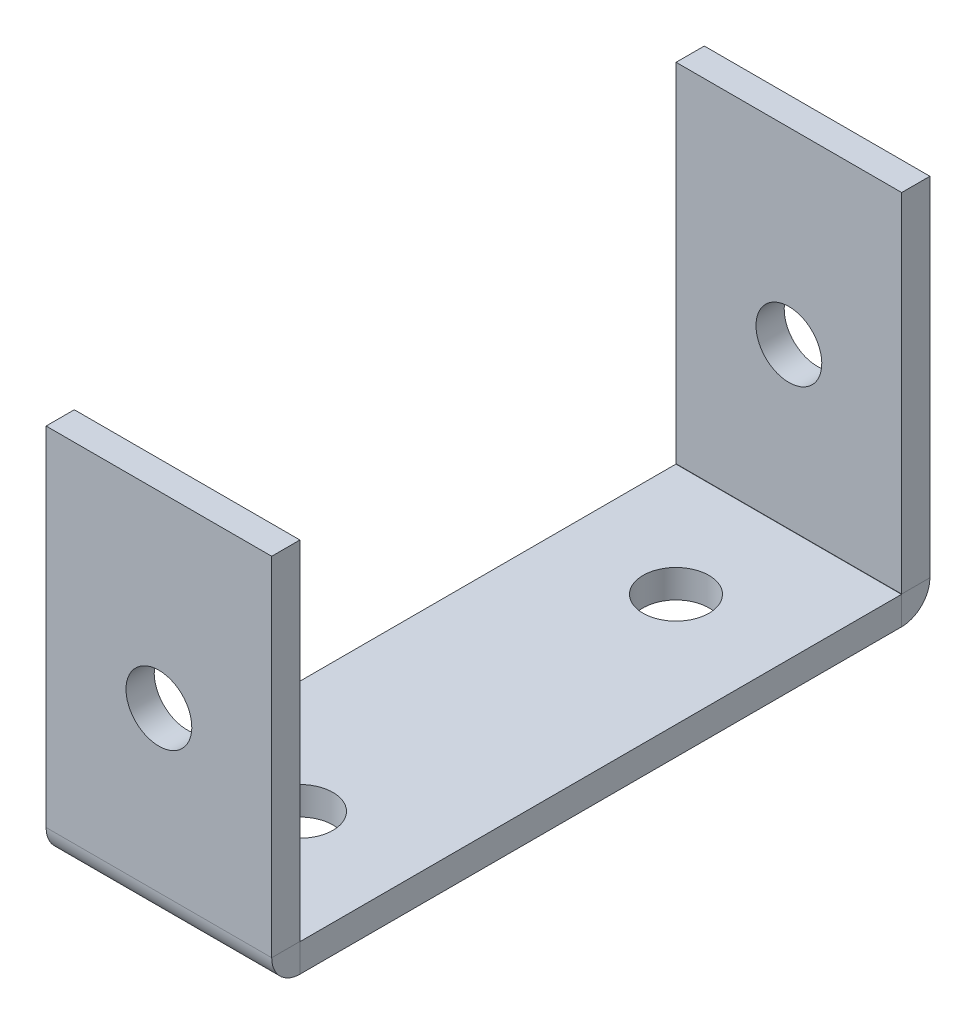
ISO-10303-21;
HEADER;
FILE_DESCRIPTION(('STEP AP214'),'2;1');
FILE_NAME('part.step','',(''),(''),'','','');
FILE_SCHEMA(('AUTOMOTIVE_DESIGN { 1 0 10303 214 1 1 1 1 }'));
ENDSEC;
DATA;
#1=APPLICATION_CONTEXT('core data for automotive mechanical design processes');
#2=APPLICATION_PROTOCOL_DEFINITION('international standard','automotive_design',2000,#1);
#3=PRODUCT_CONTEXT('',#1,'mechanical');
#4=PRODUCT('Part','Part','',(#3));
#5=PRODUCT_RELATED_PRODUCT_CATEGORY('part','',(#4));
#6=PRODUCT_DEFINITION_FORMATION('','',#4);
#7=PRODUCT_DEFINITION_CONTEXT('part definition',#1,'design');
#8=PRODUCT_DEFINITION('design','',#6,#7);
#9=PRODUCT_DEFINITION_SHAPE('','',#8);
#10=(LENGTH_UNIT() NAMED_UNIT(*) SI_UNIT(.MILLI.,.METRE.));
#11=(NAMED_UNIT(*) PLANE_ANGLE_UNIT() SI_UNIT($,.RADIAN.));
#12=(NAMED_UNIT(*) SI_UNIT($,.STERADIAN.) SOLID_ANGLE_UNIT());
#13=UNCERTAINTY_MEASURE_WITH_UNIT(LENGTH_MEASURE(1.E-05),#10,'distance_accuracy_value','');
#14=(GEOMETRIC_REPRESENTATION_CONTEXT(3) GLOBAL_UNCERTAINTY_ASSIGNED_CONTEXT((#13)) GLOBAL_UNIT_ASSIGNED_CONTEXT((#10,
#11,#12)) REPRESENTATION_CONTEXT('',''));
#15=CARTESIAN_POINT('',(0.,0.,0.));
#16=DIRECTION('',(0.,0.,1.));
#17=DIRECTION('',(1.,0.,0.));
#18=AXIS2_PLACEMENT_3D('',#15,#16,#17);
#19=CARTESIAN_POINT('',(12.,1.5,0.));
#20=DIRECTION('',(-1.,0.,0.));
#21=DIRECTION('',(0.,0.,1.));
#22=AXIS2_PLACEMENT_3D('',#19,#20,#21);
#23=PLANE('',#22);
#24=DIRECTION('',(0.,0.,-1.));
#25=VECTOR('',#24,1.);
#26=CARTESIAN_POINT('',(12.,1.5,0.));
#27=LINE('',#26,#25);
#28=CARTESIAN_POINT('',(12.,1.50000000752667,-21.505));
#29=VERTEX_POINT('',#28);
#30=CARTESIAN_POINT('',(12.,1.5,-53.495));
#31=VERTEX_POINT('',#30);
#32=EDGE_CURVE('E247',#29,#31,#27,.T.);
#33=ORIENTED_EDGE('',*,*,#32,.F.);
#34=DIRECTION('',(0.,-1.,0.));
#35=VECTOR('',#34,1.);
#36=CARTESIAN_POINT('',(12.,1.5,-21.505));
#37=LINE('',#36,#35);
#38=CARTESIAN_POINT('',(12.,0.,-21.505));
#39=VERTEX_POINT('',#38);
#40=EDGE_CURVE('E12',#29,#39,#37,.T.);
#41=ORIENTED_EDGE('',*,*,#40,.T.);
#42=DIRECTION('',(0.,0.,-1.));
#43=VECTOR('',#42,1.);
#44=CARTESIAN_POINT('',(12.,0.,0.));
#45=LINE('',#44,#43);
#46=CARTESIAN_POINT('',(12.,0.,-53.495));
#47=VERTEX_POINT('',#46);
#48=EDGE_CURVE('E262',#39,#47,#45,.T.);
#49=ORIENTED_EDGE('',*,*,#48,.T.);
#50=DIRECTION('',(0.,-1.,0.));
#51=VECTOR('',#50,1.);
#52=CARTESIAN_POINT('',(12.,1.5,-53.495));
#53=LINE('',#52,#51);
#54=EDGE_CURVE('E246',#31,#47,#53,.T.);
#55=ORIENTED_EDGE('',*,*,#54,.F.);
#56=EDGE_LOOP('',(#33,#41,#49,#55));
#57=FACE_BOUND('',#56,.T.);
#58=ADVANCED_FACE('F40',(#57),#23,.F.);
#59=CARTESIAN_POINT('',(0.,1.5,0.));
#60=DIRECTION('',(1.,0.,0.));
#61=DIRECTION('',(0.,0.,-1.));
#62=AXIS2_PLACEMENT_3D('',#59,#60,#61);
#63=PLANE('',#62);
#64=DIRECTION('',(0.,0.,1.));
#65=VECTOR('',#64,1.);
#66=CARTESIAN_POINT('',(0.,0.,0.));
#67=LINE('',#66,#65);
#68=CARTESIAN_POINT('',(0.,0.,-53.495));
#69=VERTEX_POINT('',#68);
#70=CARTESIAN_POINT('',(0.,1.50533502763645E-08,-21.5049999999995));
#71=VERTEX_POINT('',#70);
#72=EDGE_CURVE('E62',#69,#71,#67,.T.);
#73=ORIENTED_EDGE('',*,*,#72,.T.);
#74=DIRECTION('',(0.,1.,0.));
#75=VECTOR('',#74,1.);
#76=CARTESIAN_POINT('',(0.,1.5,-21.505));
#77=LINE('',#76,#75);
#78=CARTESIAN_POINT('',(0.,1.50000000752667,-21.505));
#79=VERTEX_POINT('',#78);
#80=EDGE_CURVE('E258',#71,#79,#77,.T.);
#81=ORIENTED_EDGE('',*,*,#80,.T.);
#82=DIRECTION('',(0.,0.,1.));
#83=VECTOR('',#82,1.);
#84=CARTESIAN_POINT('',(0.,1.5,0.));
#85=LINE('',#84,#83);
#86=CARTESIAN_POINT('',(0.,1.4999999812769,-53.495));
#87=VERTEX_POINT('',#86);
#88=EDGE_CURVE('E43',#87,#79,#85,.T.);
#89=ORIENTED_EDGE('',*,*,#88,.F.);
#90=DIRECTION('',(0.,1.,0.));
#91=VECTOR('',#90,1.);
#92=CARTESIAN_POINT('',(0.,1.5,-53.495));
#93=LINE('',#92,#91);
#94=EDGE_CURVE('E252',#69,#87,#93,.T.);
#95=ORIENTED_EDGE('',*,*,#94,.F.);
#96=EDGE_LOOP('',(#73,#81,#89,#95));
#97=FACE_BOUND('',#96,.T.);
#98=ADVANCED_FACE('F272',(#97),#63,.F.);
#99=CARTESIAN_POINT('',(0.,1.5,-75.));
#100=DIRECTION('',(0.,-1.,0.));
#101=DIRECTION('',(0.,0.,-1.));
#102=AXIS2_PLACEMENT_3D('',#99,#100,#101);
#103=PLANE('',#102);
#104=CARTESIAN_POINT('',(6.,1.5,-47.5));
#105=DIRECTION('',(0.,1.,0.));
#106=DIRECTION('',(0.,0.,1.));
#107=AXIS2_PLACEMENT_3D('',#104,#105,#106);
#108=CIRCLE('',#107,1.75);
#109=CARTESIAN_POINT('',(6.,1.5,-45.75));
#110=VERTEX_POINT('',#109);
#111=EDGE_CURVE('E240',#110,#110,#108,.T.);
#112=ORIENTED_EDGE('',*,*,#111,.F.);
#113=EDGE_LOOP('',(#112));
#114=FACE_BOUND('',#113,.T.);
#115=CARTESIAN_POINT('',(6.,1.5,-27.5));
#116=DIRECTION('',(0.,1.,0.));
#117=DIRECTION('',(0.,0.,1.));
#118=AXIS2_PLACEMENT_3D('',#115,#116,#117);
#119=CIRCLE('',#118,1.75);
#120=CARTESIAN_POINT('',(6.,1.5,-25.75));
#121=VERTEX_POINT('',#120);
#122=EDGE_CURVE('E234',#121,#121,#119,.T.);
#123=ORIENTED_EDGE('',*,*,#122,.F.);
#124=EDGE_LOOP('',(#123));
#125=FACE_BOUND('',#124,.T.);
#126=ORIENTED_EDGE('',*,*,#88,.T.);
#127=DIRECTION('',(1.,0.,0.));
#128=VECTOR('',#127,1.);
#129=CARTESIAN_POINT('',(0.,1.5,-21.505));
#130=LINE('',#129,#128);
#131=EDGE_CURVE('E255',#79,#29,#130,.T.);
#132=ORIENTED_EDGE('',*,*,#131,.T.);
#133=ORIENTED_EDGE('',*,*,#32,.T.);
#134=DIRECTION('',(1.,0.,0.));
#135=VECTOR('',#134,1.);
#136=CARTESIAN_POINT('',(0.,1.5,-53.495));
#137=LINE('',#136,#135);
#138=EDGE_CURVE('E243',#87,#31,#137,.T.);
#139=ORIENTED_EDGE('',*,*,#138,.F.);
#140=EDGE_LOOP('',(#126,#132,#133,#139));
#141=FACE_BOUND('',#140,.T.);
#142=ADVANCED_FACE('F269',(#114,#125,#141),#103,.F.);
#143=CARTESIAN_POINT('',(0.,0.,-75.));
#144=DIRECTION('',(0.,-1.,0.));
#145=DIRECTION('',(0.,0.,-1.));
#146=AXIS2_PLACEMENT_3D('',#143,#144,#145);
#147=PLANE('',#146);
#148=DIRECTION('',(1.,0.,0.));
#149=VECTOR('',#148,1.);
#150=CARTESIAN_POINT('',(0.,0.,-21.505));
#151=LINE('',#150,#149);
#152=EDGE_CURVE('E48',#71,#39,#151,.T.);
#153=ORIENTED_EDGE('',*,*,#152,.F.);
#154=ORIENTED_EDGE('',*,*,#72,.F.);
#155=DIRECTION('',(1.,0.,0.));
#156=VECTOR('',#155,1.);
#157=CARTESIAN_POINT('',(0.,0.,-53.495));
#158=LINE('',#157,#156);
#159=EDGE_CURVE('E250',#69,#47,#158,.T.);
#160=ORIENTED_EDGE('',*,*,#159,.T.);
#161=ORIENTED_EDGE('',*,*,#48,.F.);
#162=EDGE_LOOP('',(#153,#154,#160,#161));
#163=FACE_BOUND('',#162,.T.);
#164=CARTESIAN_POINT('',(6.,0.,-27.5));
#165=DIRECTION('',(0.,1.,0.));
#166=DIRECTION('',(0.,0.,1.));
#167=AXIS2_PLACEMENT_3D('',#164,#165,#166);
#168=CIRCLE('',#167,1.75);
#169=CARTESIAN_POINT('',(6.,0.,-25.75));
#170=VERTEX_POINT('',#169);
#171=EDGE_CURVE('E231',#170,#170,#168,.T.);
#172=ORIENTED_EDGE('',*,*,#171,.T.);
#173=EDGE_LOOP('',(#172));
#174=FACE_BOUND('',#173,.T.);
#175=CARTESIAN_POINT('',(6.,0.,-47.5));
#176=DIRECTION('',(0.,1.,0.));
#177=DIRECTION('',(0.,0.,1.));
#178=AXIS2_PLACEMENT_3D('',#175,#176,#177);
#179=CIRCLE('',#178,1.75);
#180=CARTESIAN_POINT('',(6.,0.,-45.75));
#181=VERTEX_POINT('',#180);
#182=EDGE_CURVE('E237',#181,#181,#179,.T.);
#183=ORIENTED_EDGE('',*,*,#182,.T.);
#184=EDGE_LOOP('',(#183));
#185=FACE_BOUND('',#184,.T.);
#186=ADVANCED_FACE('F340',(#163,#174,#185),#147,.T.);
#187=CARTESIAN_POINT('',(6.,1.5,-47.5));
#188=DIRECTION('',(0.,-1.,0.));
#189=DIRECTION('',(0.,0.,-1.));
#190=AXIS2_PLACEMENT_3D('',#187,#188,#189);
#191=CYLINDRICAL_SURFACE('',#190,1.75);
#192=ORIENTED_EDGE('',*,*,#111,.T.);
#193=EDGE_LOOP('',(#192));
#194=FACE_BOUND('',#193,.T.);
#195=ORIENTED_EDGE('',*,*,#182,.F.);
#196=EDGE_LOOP('',(#195));
#197=FACE_BOUND('',#196,.T.);
#198=ADVANCED_FACE('F343',(#194,#197),#191,.F.);
#199=CARTESIAN_POINT('',(6.,1.5,-27.5));
#200=DIRECTION('',(0.,-1.,0.));
#201=DIRECTION('',(0.,0.,-1.));
#202=AXIS2_PLACEMENT_3D('',#199,#200,#201);
#203=CYLINDRICAL_SURFACE('',#202,1.75);
#204=ORIENTED_EDGE('',*,*,#122,.T.);
#205=EDGE_LOOP('',(#204));
#206=FACE_BOUND('',#205,.T.);
#207=ORIENTED_EDGE('',*,*,#171,.F.);
#208=EDGE_LOOP('',(#207));
#209=FACE_BOUND('',#208,.T.);
#210=ADVANCED_FACE('F349',(#206,#209),#203,.F.);
#211=CARTESIAN_POINT('',(0.,1.51000003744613,-53.495));
#212=DIRECTION('',(1.,0.,0.));
#213=DIRECTION('',(0.,0.,-1.));
#214=AXIS2_PLACEMENT_3D('',#211,#212,#213);
#215=PLANE('',#214);
#216=DIRECTION('',(0.,0.,1.));
#217=VECTOR('',#216,1.);
#218=CARTESIAN_POINT('',(0.,1.51,-53.505));
#219=LINE('',#218,#217);
#220=CARTESIAN_POINT('',(0.,1.51,-55.005));
#221=VERTEX_POINT('',#220);
#222=CARTESIAN_POINT('',(0.,1.51,-53.505));
#223=VERTEX_POINT('',#222);
#224=EDGE_CURVE('E188',#221,#223,#219,.T.);
#225=ORIENTED_EDGE('',*,*,#224,.F.);
#226=CARTESIAN_POINT('',(0.,1.51,-53.495));
#227=DIRECTION('',(-1.,0.,0.));
#228=DIRECTION('',(0.,0.,1.));
#229=AXIS2_PLACEMENT_3D('',#226,#227,#228);
#230=CIRCLE('',#229,1.51000003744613);
#231=EDGE_CURVE('E187',#221,#69,#230,.T.);
#232=ORIENTED_EDGE('',*,*,#231,.T.);
#233=ORIENTED_EDGE('',*,*,#94,.T.);
#234=CARTESIAN_POINT('',(0.,1.51000003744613,-53.495));
#235=DIRECTION('',(-1.,0.,0.));
#236=DIRECTION('',(0.,0.,1.));
#237=AXIS2_PLACEMENT_3D('',#234,#235,#236);
#238=CIRCLE('',#237,0.0100000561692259);
#239=EDGE_CURVE('E223',#223,#87,#238,.T.);
#240=ORIENTED_EDGE('',*,*,#239,.F.);
#241=EDGE_LOOP('',(#225,#232,#233,#240));
#242=FACE_BOUND('',#241,.T.);
#243=ADVANCED_FACE('F336',(#242),#215,.F.);
#244=CARTESIAN_POINT('',(12.,1.51000003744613,-53.495));
#245=DIRECTION('',(-1.,0.,0.));
#246=DIRECTION('',(0.,0.,1.));
#247=AXIS2_PLACEMENT_3D('',#244,#245,#246);
#248=PLANE('',#247);
#249=ORIENTED_EDGE('',*,*,#54,.T.);
#250=CARTESIAN_POINT('',(12.,1.51,-53.495));
#251=DIRECTION('',(-1.,0.,0.));
#252=DIRECTION('',(0.,0.,1.));
#253=AXIS2_PLACEMENT_3D('',#250,#251,#252);
#254=CIRCLE('',#253,1.51000003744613);
#255=CARTESIAN_POINT('',(12.,1.51,-55.005));
#256=VERTEX_POINT('',#255);
#257=EDGE_CURVE('E220',#47,#256,#254,.F.);
#258=ORIENTED_EDGE('',*,*,#257,.T.);
#259=DIRECTION('',(0.,0.,-1.));
#260=VECTOR('',#259,1.);
#261=CARTESIAN_POINT('',(12.,1.51,-53.505));
#262=LINE('',#261,#260);
#263=CARTESIAN_POINT('',(12.,1.50999999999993,-53.5050000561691));
#264=VERTEX_POINT('',#263);
#265=EDGE_CURVE('E198',#264,#256,#262,.T.);
#266=ORIENTED_EDGE('',*,*,#265,.F.);
#267=CARTESIAN_POINT('',(12.,1.51000003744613,-53.495));
#268=DIRECTION('',(1.,0.,0.));
#269=DIRECTION('',(0.,0.,-1.));
#270=AXIS2_PLACEMENT_3D('',#267,#268,#269);
#271=CIRCLE('',#270,0.0100000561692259);
#272=EDGE_CURVE('E228',#31,#264,#271,.T.);
#273=ORIENTED_EDGE('',*,*,#272,.F.);
#274=EDGE_LOOP('',(#249,#258,#266,#273));
#275=FACE_BOUND('',#274,.T.);
#276=ADVANCED_FACE('F320',(#275),#248,.F.);
#277=CARTESIAN_POINT('',(18.46234729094,1.51,-53.495));
#278=DIRECTION('',(-1.,0.,0.));
#279=DIRECTION('',(0.,0.,1.));
#280=AXIS2_PLACEMENT_3D('',#277,#278,#279);
#281=CYLINDRICAL_SURFACE('',#280,0.010000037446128);
#282=ORIENTED_EDGE('',*,*,#272,.T.);
#283=DIRECTION('',(1.,0.,0.));
#284=VECTOR('',#283,1.);
#285=CARTESIAN_POINT('',(0.,1.51,-53.505));
#286=LINE('',#285,#284);
#287=EDGE_CURVE('E205',#223,#264,#286,.T.);
#288=ORIENTED_EDGE('',*,*,#287,.F.);
#289=ORIENTED_EDGE('',*,*,#239,.T.);
#290=ORIENTED_EDGE('',*,*,#138,.T.);
#291=EDGE_LOOP('',(#282,#288,#289,#290));
#292=FACE_BOUND('',#291,.T.);
#293=ADVANCED_FACE('F316',(#292),#281,.F.);
#294=CARTESIAN_POINT('',(18.46234729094,1.51,-53.495));
#295=DIRECTION('',(-1.,0.,0.));
#296=DIRECTION('',(0.,0.,1.));
#297=AXIS2_PLACEMENT_3D('',#294,#295,#296);
#298=CYLINDRICAL_SURFACE('',#297,1.51000003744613);
#299=ORIENTED_EDGE('',*,*,#257,.F.);
#300=ORIENTED_EDGE('',*,*,#159,.F.);
#301=ORIENTED_EDGE('',*,*,#231,.F.);
#302=DIRECTION('',(1.,0.,0.));
#303=VECTOR('',#302,1.);
#304=CARTESIAN_POINT('',(0.,1.51,-55.005));
#305=LINE('',#304,#303);
#306=EDGE_CURVE('E183',#221,#256,#305,.T.);
#307=ORIENTED_EDGE('',*,*,#306,.T.);
#308=EDGE_LOOP('',(#299,#300,#301,#307));
#309=FACE_BOUND('',#308,.T.);
#310=ADVANCED_FACE('F339',(#309),#298,.T.);
#311=CARTESIAN_POINT('',(0.,20.005,-53.5049999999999));
#312=DIRECTION('',(0.,-1.,0.));
#313=DIRECTION('',(1.,0.,0.));
#314=AXIS2_PLACEMENT_3D('',#311,#312,#313);
#315=PLANE('',#314);
#316=DIRECTION('',(-1.,0.,0.));
#317=VECTOR('',#316,1.);
#318=CARTESIAN_POINT('',(0.,20.005,-55.0049999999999));
#319=LINE('',#318,#317);
#320=CARTESIAN_POINT('',(12.,20.005,-55.0049999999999));
#321=VERTEX_POINT('',#320);
#322=CARTESIAN_POINT('',(0.,20.005,-55.0049999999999));
#323=VERTEX_POINT('',#322);
#324=EDGE_CURVE('E216',#321,#323,#319,.T.);
#325=ORIENTED_EDGE('',*,*,#324,.T.);
#326=DIRECTION('',(0.,0.,-1.));
#327=VECTOR('',#326,1.);
#328=CARTESIAN_POINT('',(0.,20.005,-53.5049999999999));
#329=LINE('',#328,#327);
#330=CARTESIAN_POINT('',(0.,20.005,-53.5049999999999));
#331=VERTEX_POINT('',#330);
#332=EDGE_CURVE('E184',#331,#323,#329,.T.);
#333=ORIENTED_EDGE('',*,*,#332,.F.);
#334=DIRECTION('',(-1.,0.,0.));
#335=VECTOR('',#334,1.);
#336=CARTESIAN_POINT('',(0.,20.005,-53.5049999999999));
#337=LINE('',#336,#335);
#338=CARTESIAN_POINT('',(12.,20.005,-53.5049999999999));
#339=VERTEX_POINT('',#338);
#340=EDGE_CURVE('E201',#339,#331,#337,.T.);
#341=ORIENTED_EDGE('',*,*,#340,.F.);
#342=DIRECTION('',(0.,0.,-1.));
#343=VECTOR('',#342,1.);
#344=CARTESIAN_POINT('',(12.,20.005,-53.5049999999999));
#345=LINE('',#344,#343);
#346=EDGE_CURVE('E213',#339,#321,#345,.T.);
#347=ORIENTED_EDGE('',*,*,#346,.T.);
#348=EDGE_LOOP('',(#325,#333,#341,#347));
#349=FACE_BOUND('',#348,.T.);
#350=ADVANCED_FACE('F410',(#349),#315,.F.);
#351=CARTESIAN_POINT('',(6.,10.005,-53.505));
#352=DIRECTION('',(0.,0.,-1.));
#353=DIRECTION('',(0.,1.,0.));
#354=AXIS2_PLACEMENT_3D('',#351,#352,#353);
#355=CYLINDRICAL_SURFACE('',#354,1.75);
#356=CARTESIAN_POINT('',(6.,10.005,-53.505));
#357=DIRECTION('',(0.,0.,1.));
#358=DIRECTION('',(0.,-1.,0.));
#359=AXIS2_PLACEMENT_3D('',#356,#357,#358);
#360=CIRCLE('',#359,1.75);
#361=CARTESIAN_POINT('',(6.,8.25500000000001,-53.505));
#362=VERTEX_POINT('',#361);
#363=EDGE_CURVE('E210',#362,#362,#360,.T.);
#364=ORIENTED_EDGE('',*,*,#363,.T.);
#365=EDGE_LOOP('',(#364));
#366=FACE_BOUND('',#365,.T.);
#367=CARTESIAN_POINT('',(6.,10.005,-55.005));
#368=DIRECTION('',(0.,0.,1.));
#369=DIRECTION('',(0.,-1.,0.));
#370=AXIS2_PLACEMENT_3D('',#367,#368,#369);
#371=CIRCLE('',#370,1.75);
#372=CARTESIAN_POINT('',(6.,8.25500000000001,-55.005));
#373=VERTEX_POINT('',#372);
#374=EDGE_CURVE('E193',#373,#373,#371,.T.);
#375=ORIENTED_EDGE('',*,*,#374,.F.);
#376=EDGE_LOOP('',(#375));
#377=FACE_BOUND('',#376,.T.);
#378=ADVANCED_FACE('F421',(#366,#377),#355,.F.);
#379=CARTESIAN_POINT('',(0.,20.005,-53.5049999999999));
#380=DIRECTION('',(0.,0.,-1.));
#381=DIRECTION('',(0.,1.,0.));
#382=AXIS2_PLACEMENT_3D('',#379,#380,#381);
#383=PLANE('',#382);
#384=ORIENTED_EDGE('',*,*,#363,.F.);
#385=EDGE_LOOP('',(#384));
#386=FACE_BOUND('',#385,.T.);
#387=DIRECTION('',(0.,-1.,0.));
#388=VECTOR('',#387,1.);
#389=CARTESIAN_POINT('',(0.,-54.995,-53.5050000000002));
#390=LINE('',#389,#388);
#391=EDGE_CURVE('E208',#331,#223,#390,.T.);
#392=ORIENTED_EDGE('',*,*,#391,.T.);
#393=ORIENTED_EDGE('',*,*,#287,.T.);
#394=DIRECTION('',(0.,1.,0.));
#395=VECTOR('',#394,1.);
#396=CARTESIAN_POINT('',(12.,-54.995,-53.5050000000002));
#397=LINE('',#396,#395);
#398=EDGE_CURVE('E203',#264,#339,#397,.T.);
#399=ORIENTED_EDGE('',*,*,#398,.T.);
#400=ORIENTED_EDGE('',*,*,#340,.T.);
#401=EDGE_LOOP('',(#392,#393,#399,#400));
#402=FACE_BOUND('',#401,.T.);
#403=ADVANCED_FACE('F326',(#386,#402),#383,.F.);
#404=CARTESIAN_POINT('',(12.,-54.995,-53.5050000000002));
#405=DIRECTION('',(-1.,0.,0.));
#406=DIRECTION('',(0.,-1.,0.));
#407=AXIS2_PLACEMENT_3D('',#404,#405,#406);
#408=PLANE('',#407);
#409=ORIENTED_EDGE('',*,*,#398,.F.);
#410=ORIENTED_EDGE('',*,*,#265,.T.);
#411=DIRECTION('',(0.,1.,0.));
#412=VECTOR('',#411,1.);
#413=CARTESIAN_POINT('',(12.,-54.995,-55.0050000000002));
#414=LINE('',#413,#412);
#415=EDGE_CURVE('E196',#256,#321,#414,.T.);
#416=ORIENTED_EDGE('',*,*,#415,.T.);
#417=ORIENTED_EDGE('',*,*,#346,.F.);
#418=EDGE_LOOP('',(#409,#410,#416,#417));
#419=FACE_BOUND('',#418,.T.);
#420=ADVANCED_FACE('F322',(#419),#408,.F.);
#421=CARTESIAN_POINT('',(0.,20.005,-55.0049999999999));
#422=DIRECTION('',(0.,0.,-1.));
#423=DIRECTION('',(0.,1.,0.));
#424=AXIS2_PLACEMENT_3D('',#421,#422,#423);
#425=PLANE('',#424);
#426=ORIENTED_EDGE('',*,*,#306,.F.);
#427=DIRECTION('',(0.,-1.,0.));
#428=VECTOR('',#427,1.);
#429=CARTESIAN_POINT('',(0.,-54.995,-55.0050000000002));
#430=LINE('',#429,#428);
#431=EDGE_CURVE('E191',#323,#221,#430,.T.);
#432=ORIENTED_EDGE('',*,*,#431,.F.);
#433=ORIENTED_EDGE('',*,*,#324,.F.);
#434=ORIENTED_EDGE('',*,*,#415,.F.);
#435=EDGE_LOOP('',(#426,#432,#433,#434));
#436=FACE_BOUND('',#435,.T.);
#437=ORIENTED_EDGE('',*,*,#374,.T.);
#438=EDGE_LOOP('',(#437));
#439=FACE_BOUND('',#438,.T.);
#440=ADVANCED_FACE('F454',(#436,#439),#425,.T.);
#441=CARTESIAN_POINT('',(0.,-54.995,-53.5050000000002));
#442=DIRECTION('',(1.,0.,0.));
#443=DIRECTION('',(0.,1.,0.));
#444=AXIS2_PLACEMENT_3D('',#441,#442,#443);
#445=PLANE('',#444);
#446=ORIENTED_EDGE('',*,*,#431,.T.);
#447=ORIENTED_EDGE('',*,*,#224,.T.);
#448=ORIENTED_EDGE('',*,*,#391,.F.);
#449=ORIENTED_EDGE('',*,*,#332,.T.);
#450=EDGE_LOOP('',(#446,#447,#448,#449));
#451=FACE_BOUND('',#450,.T.);
#452=ADVANCED_FACE('F331',(#451),#445,.F.);
#453=CARTESIAN_POINT('',(0.,1.50999998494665,-21.505));
#454=DIRECTION('',(1.,0.,0.));
#455=DIRECTION('',(0.,0.,-1.));
#456=AXIS2_PLACEMENT_3D('',#453,#454,#455);
#457=PLANE('',#456);
#458=ORIENTED_EDGE('',*,*,#80,.F.);
#459=CARTESIAN_POINT('',(0.,1.51,-21.505));
#460=DIRECTION('',(1.,0.,0.));
#461=DIRECTION('',(0.,0.,-1.));
#462=AXIS2_PLACEMENT_3D('',#459,#460,#461);
#463=CIRCLE('',#462,1.50999998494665);
#464=CARTESIAN_POINT('',(0.,1.51000000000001,-19.995));
#465=VERTEX_POINT('',#464);
#466=EDGE_CURVE('E175',#71,#465,#463,.F.);
#467=ORIENTED_EDGE('',*,*,#466,.T.);
#468=DIRECTION('',(0.,0.,-1.));
#469=VECTOR('',#468,1.);
#470=CARTESIAN_POINT('',(0.,1.51,-21.495));
#471=LINE('',#470,#469);
#472=CARTESIAN_POINT('',(0.,1.51,-21.495));
#473=VERTEX_POINT('',#472);
#474=EDGE_CURVE('E139',#465,#473,#471,.T.);
#475=ORIENTED_EDGE('',*,*,#474,.T.);
#476=CARTESIAN_POINT('',(0.,1.50999998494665,-21.505));
#477=DIRECTION('',(-1.,0.,0.));
#478=DIRECTION('',(0.,0.,1.));
#479=AXIS2_PLACEMENT_3D('',#476,#477,#478);
#480=CIRCLE('',#479,0.00999997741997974);
#481=EDGE_CURVE('E174',#79,#473,#480,.T.);
#482=ORIENTED_EDGE('',*,*,#481,.F.);
#483=EDGE_LOOP('',(#458,#467,#475,#482));
#484=FACE_BOUND('',#483,.T.);
#485=ADVANCED_FACE('F274',(#484),#457,.F.);
#486=CARTESIAN_POINT('',(12.,1.50999998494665,-21.505));
#487=DIRECTION('',(-1.,0.,0.));
#488=DIRECTION('',(0.,0.,1.));
#489=AXIS2_PLACEMENT_3D('',#486,#487,#488);
#490=PLANE('',#489);
#491=DIRECTION('',(0.,0.,1.));
#492=VECTOR('',#491,1.);
#493=CARTESIAN_POINT('',(12.,1.51,-21.495));
#494=LINE('',#493,#492);
#495=CARTESIAN_POINT('',(12.,1.51,-21.4950000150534));
#496=VERTEX_POINT('',#495);
#497=CARTESIAN_POINT('',(12.,1.51000000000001,-19.995));
#498=VERTEX_POINT('',#497);
#499=EDGE_CURVE('E166',#496,#498,#494,.T.);
#500=ORIENTED_EDGE('',*,*,#499,.T.);
#501=CARTESIAN_POINT('',(12.,1.51,-21.505));
#502=DIRECTION('',(1.,0.,0.));
#503=DIRECTION('',(0.,0.,-1.));
#504=AXIS2_PLACEMENT_3D('',#501,#502,#503);
#505=CIRCLE('',#504,1.50999998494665);
#506=EDGE_CURVE('E172',#498,#39,#505,.T.);
#507=ORIENTED_EDGE('',*,*,#506,.T.);
#508=ORIENTED_EDGE('',*,*,#40,.F.);
#509=CARTESIAN_POINT('',(12.,1.50999998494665,-21.505));
#510=DIRECTION('',(1.,0.,0.));
#511=DIRECTION('',(0.,0.,-1.));
#512=AXIS2_PLACEMENT_3D('',#509,#510,#511);
#513=CIRCLE('',#512,0.00999997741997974);
#514=EDGE_CURVE('E180',#496,#29,#513,.T.);
#515=ORIENTED_EDGE('',*,*,#514,.F.);
#516=EDGE_LOOP('',(#500,#507,#508,#515));
#517=FACE_BOUND('',#516,.T.);
#518=ADVANCED_FACE('F293',(#517),#490,.F.);
#519=CARTESIAN_POINT('',(-6.46234729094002,1.51,-21.505));
#520=DIRECTION('',(1.,0.,0.));
#521=DIRECTION('',(0.,0.,-1.));
#522=AXIS2_PLACEMENT_3D('',#519,#520,#521);
#523=CYLINDRICAL_SURFACE('',#522,0.0099999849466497);
#524=ORIENTED_EDGE('',*,*,#514,.T.);
#525=ORIENTED_EDGE('',*,*,#131,.F.);
#526=ORIENTED_EDGE('',*,*,#481,.T.);
#527=DIRECTION('',(1.,0.,0.));
#528=VECTOR('',#527,1.);
#529=CARTESIAN_POINT('',(0.,1.51,-21.495));
#530=LINE('',#529,#528);
#531=EDGE_CURVE('E169',#473,#496,#530,.T.);
#532=ORIENTED_EDGE('',*,*,#531,.T.);
#533=EDGE_LOOP('',(#524,#525,#526,#532));
#534=FACE_BOUND('',#533,.T.);
#535=ADVANCED_FACE('F296',(#534),#523,.F.);
#536=CARTESIAN_POINT('',(-6.46234729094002,1.51,-21.505));
#537=DIRECTION('',(1.,0.,0.));
#538=DIRECTION('',(0.,0.,-1.));
#539=AXIS2_PLACEMENT_3D('',#536,#537,#538);
#540=CYLINDRICAL_SURFACE('',#539,1.50999998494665);
#541=ORIENTED_EDGE('',*,*,#506,.F.);
#542=DIRECTION('',(1.,0.,0.));
#543=VECTOR('',#542,1.);
#544=CARTESIAN_POINT('',(0.,1.51,-19.995));
#545=LINE('',#544,#543);
#546=EDGE_CURVE('E276',#465,#498,#545,.T.);
#547=ORIENTED_EDGE('',*,*,#546,.F.);
#548=ORIENTED_EDGE('',*,*,#466,.F.);
#549=ORIENTED_EDGE('',*,*,#152,.T.);
#550=EDGE_LOOP('',(#541,#547,#548,#549));
#551=FACE_BOUND('',#550,.T.);
#552=ADVANCED_FACE('F275',(#551),#540,.T.);
#553=CARTESIAN_POINT('',(6.,10.005,-21.495));
#554=DIRECTION('',(0.,0.,1.));
#555=DIRECTION('',(0.,-1.,0.));
#556=AXIS2_PLACEMENT_3D('',#553,#554,#555);
#557=CYLINDRICAL_SURFACE('',#556,1.75);
#558=CARTESIAN_POINT('',(6.,10.005,-21.495));
#559=DIRECTION('',(0.,0.,-1.));
#560=DIRECTION('',(0.,1.,0.));
#561=AXIS2_PLACEMENT_3D('',#558,#559,#560);
#562=CIRCLE('',#561,1.75);
#563=CARTESIAN_POINT('',(6.,11.755,-21.495));
#564=VERTEX_POINT('',#563);
#565=EDGE_CURVE('E153',#564,#564,#562,.T.);
#566=ORIENTED_EDGE('',*,*,#565,.T.);
#567=EDGE_LOOP('',(#566));
#568=FACE_BOUND('',#567,.T.);
#569=CARTESIAN_POINT('',(6.,10.005,-19.995));
#570=DIRECTION('',(0.,0.,-1.));
#571=DIRECTION('',(0.,1.,0.));
#572=AXIS2_PLACEMENT_3D('',#569,#570,#571);
#573=CIRCLE('',#572,1.75);
#574=CARTESIAN_POINT('',(6.,11.755,-19.995));
#575=VERTEX_POINT('',#574);
#576=EDGE_CURVE('E143',#575,#575,#573,.T.);
#577=ORIENTED_EDGE('',*,*,#576,.F.);
#578=EDGE_LOOP('',(#577));
#579=FACE_BOUND('',#578,.T.);
#580=ADVANCED_FACE('F303',(#568,#579),#557,.F.);
#581=CARTESIAN_POINT('',(0.,20.005,-21.4950000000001));
#582=DIRECTION('',(0.,-1.,0.));
#583=DIRECTION('',(-1.,0.,0.));
#584=AXIS2_PLACEMENT_3D('',#581,#582,#583);
#585=PLANE('',#584);
#586=DIRECTION('',(1.,0.,0.));
#587=VECTOR('',#586,1.);
#588=CARTESIAN_POINT('',(0.,20.005,-19.9950000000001));
#589=LINE('',#588,#587);
#590=CARTESIAN_POINT('',(0.,20.005,-19.9950000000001));
#591=VERTEX_POINT('',#590);
#592=CARTESIAN_POINT('',(12.,20.005,-19.9950000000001));
#593=VERTEX_POINT('',#592);
#594=EDGE_CURVE('E147',#591,#593,#589,.T.);
#595=ORIENTED_EDGE('',*,*,#594,.T.);
#596=DIRECTION('',(0.,0.,1.));
#597=VECTOR('',#596,1.);
#598=CARTESIAN_POINT('',(12.,20.005,-21.4950000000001));
#599=LINE('',#598,#597);
#600=CARTESIAN_POINT('',(12.,20.005,-21.4950000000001));
#601=VERTEX_POINT('',#600);
#602=EDGE_CURVE('E277',#601,#593,#599,.T.);
#603=ORIENTED_EDGE('',*,*,#602,.F.);
#604=DIRECTION('',(1.,0.,0.));
#605=VECTOR('',#604,1.);
#606=CARTESIAN_POINT('',(0.,20.005,-21.4950000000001));
#607=LINE('',#606,#605);
#608=CARTESIAN_POINT('',(0.,20.005,-21.4950000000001));
#609=VERTEX_POINT('',#608);
#610=EDGE_CURVE('E157',#609,#601,#607,.T.);
#611=ORIENTED_EDGE('',*,*,#610,.F.);
#612=DIRECTION('',(0.,0.,1.));
#613=VECTOR('',#612,1.);
#614=CARTESIAN_POINT('',(0.,20.005,-21.4950000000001));
#615=LINE('',#614,#613);
#616=EDGE_CURVE('E137',#609,#591,#615,.T.);
#617=ORIENTED_EDGE('',*,*,#616,.T.);
#618=EDGE_LOOP('',(#595,#603,#611,#617));
#619=FACE_BOUND('',#618,.T.);
#620=ADVANCED_FACE('F156',(#619),#585,.F.);
#621=CARTESIAN_POINT('',(0.,-54.995,-21.4949999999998));
#622=DIRECTION('',(0.,0.,1.));
#623=DIRECTION('',(0.,-1.,0.));
#624=AXIS2_PLACEMENT_3D('',#621,#622,#623);
#625=PLANE('',#624);
#626=ORIENTED_EDGE('',*,*,#531,.F.);
#627=DIRECTION('',(0.,1.,0.));
#628=VECTOR('',#627,1.);
#629=CARTESIAN_POINT('',(0.,20.005,-21.4950000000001));
#630=LINE('',#629,#628);
#631=EDGE_CURVE('E158',#473,#609,#630,.T.);
#632=ORIENTED_EDGE('',*,*,#631,.T.);
#633=ORIENTED_EDGE('',*,*,#610,.T.);
#634=DIRECTION('',(0.,-1.,0.));
#635=VECTOR('',#634,1.);
#636=CARTESIAN_POINT('',(12.,20.005,-21.4950000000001));
#637=LINE('',#636,#635);
#638=EDGE_CURVE('E144',#601,#496,#637,.T.);
#639=ORIENTED_EDGE('',*,*,#638,.T.);
#640=EDGE_LOOP('',(#626,#632,#633,#639));
#641=FACE_BOUND('',#640,.T.);
#642=ORIENTED_EDGE('',*,*,#565,.F.);
#643=EDGE_LOOP('',(#642));
#644=FACE_BOUND('',#643,.T.);
#645=ADVANCED_FACE('F286',(#641,#644),#625,.F.);
#646=CARTESIAN_POINT('',(0.,20.005,-21.4950000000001));
#647=DIRECTION('',(1.,0.,0.));
#648=DIRECTION('',(0.,-1.,0.));
#649=AXIS2_PLACEMENT_3D('',#646,#647,#648);
#650=PLANE('',#649);
#651=ORIENTED_EDGE('',*,*,#474,.F.);
#652=DIRECTION('',(0.,1.,0.));
#653=VECTOR('',#652,1.);
#654=CARTESIAN_POINT('',(0.,20.005,-19.9950000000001));
#655=LINE('',#654,#653);
#656=EDGE_CURVE('E132',#465,#591,#655,.T.);
#657=ORIENTED_EDGE('',*,*,#656,.T.);
#658=ORIENTED_EDGE('',*,*,#616,.F.);
#659=ORIENTED_EDGE('',*,*,#631,.F.);
#660=EDGE_LOOP('',(#651,#657,#658,#659));
#661=FACE_BOUND('',#660,.T.);
#662=ADVANCED_FACE('F134',(#661),#650,.F.);
#663=CARTESIAN_POINT('',(0.,-54.995,-19.9949999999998));
#664=DIRECTION('',(0.,0.,1.));
#665=DIRECTION('',(0.,-1.,0.));
#666=AXIS2_PLACEMENT_3D('',#663,#664,#665);
#667=PLANE('',#666);
#668=ORIENTED_EDGE('',*,*,#576,.T.);
#669=EDGE_LOOP('',(#668));
#670=FACE_BOUND('',#669,.T.);
#671=ORIENTED_EDGE('',*,*,#656,.F.);
#672=ORIENTED_EDGE('',*,*,#546,.T.);
#673=DIRECTION('',(0.,-1.,0.));
#674=VECTOR('',#673,1.);
#675=CARTESIAN_POINT('',(12.,20.005,-19.9950000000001));
#676=LINE('',#675,#674);
#677=EDGE_CURVE('E149',#593,#498,#676,.T.);
#678=ORIENTED_EDGE('',*,*,#677,.F.);
#679=ORIENTED_EDGE('',*,*,#594,.F.);
#680=EDGE_LOOP('',(#671,#672,#678,#679));
#681=FACE_BOUND('',#680,.T.);
#682=ADVANCED_FACE('F148',(#670,#681),#667,.T.);
#683=CARTESIAN_POINT('',(12.,20.005,-21.4950000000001));
#684=DIRECTION('',(-1.,0.,0.));
#685=DIRECTION('',(0.,1.,0.));
#686=AXIS2_PLACEMENT_3D('',#683,#684,#685);
#687=PLANE('',#686);
#688=ORIENTED_EDGE('',*,*,#499,.F.);
#689=ORIENTED_EDGE('',*,*,#638,.F.);
#690=ORIENTED_EDGE('',*,*,#602,.T.);
#691=ORIENTED_EDGE('',*,*,#677,.T.);
#692=EDGE_LOOP('',(#688,#689,#690,#691));
#693=FACE_BOUND('',#692,.T.);
#694=ADVANCED_FACE('F290',(#693),#687,.F.);
#695=CLOSED_SHELL('',(#58,#98,#142,#186,#198,#210,#243,#276,#293,#310,#350,#378,#403,#420,#440,
#452,#485,#518,#535,#552,#580,#620,#645,#662,#682,#694));
#696=MANIFOLD_SOLID_BREP('B2',#695);
#697=ADVANCED_BREP_SHAPE_REPRESENTATION('',(#18,#696),#14);
#698=SHAPE_DEFINITION_REPRESENTATION(#9,#697);
ENDSEC;
END-ISO-10303-21;
